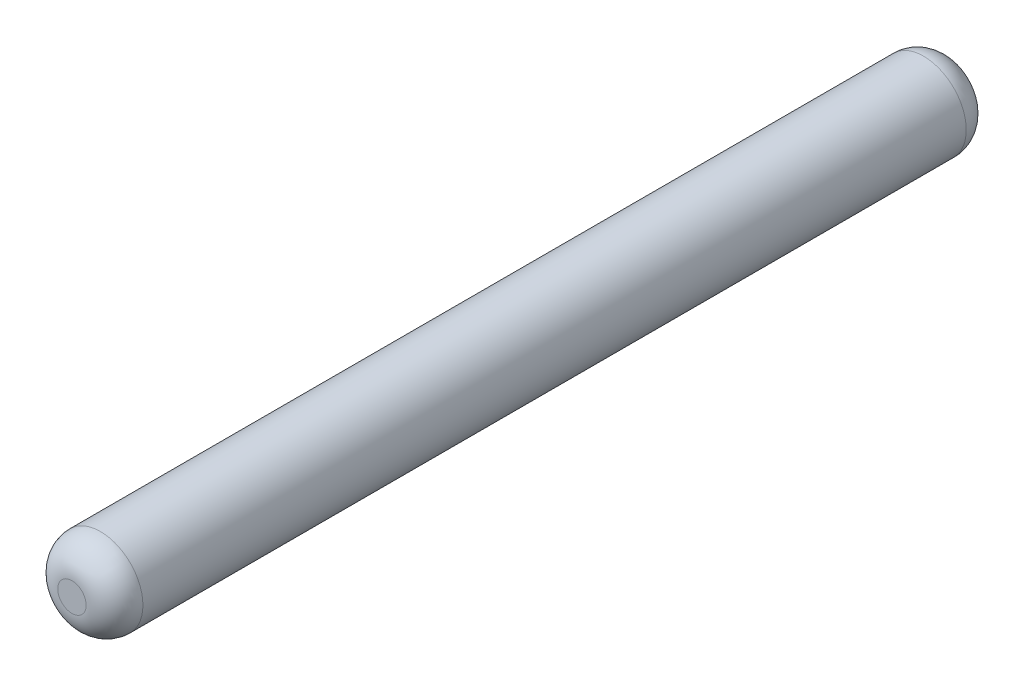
ISO-10303-21;
HEADER;
FILE_DESCRIPTION(('STEP AP214'),'2;1');
FILE_NAME('part.step','',(''),(''),'','','');
FILE_SCHEMA(('AUTOMOTIVE_DESIGN { 1 0 10303 214 1 1 1 1 }'));
ENDSEC;
DATA;
#1=APPLICATION_CONTEXT('core data for automotive mechanical design processes');
#2=APPLICATION_PROTOCOL_DEFINITION('international standard','automotive_design',2000,#1);
#3=PRODUCT_CONTEXT('',#1,'mechanical');
#4=PRODUCT('Part','Part','',(#3));
#5=PRODUCT_RELATED_PRODUCT_CATEGORY('part','',(#4));
#6=PRODUCT_DEFINITION_FORMATION('','',#4);
#7=PRODUCT_DEFINITION_CONTEXT('part definition',#1,'design');
#8=PRODUCT_DEFINITION('design','',#6,#7);
#9=PRODUCT_DEFINITION_SHAPE('','',#8);
#10=(LENGTH_UNIT() NAMED_UNIT(*) SI_UNIT(.MILLI.,.METRE.));
#11=(NAMED_UNIT(*) PLANE_ANGLE_UNIT() SI_UNIT($,.RADIAN.));
#12=(NAMED_UNIT(*) SI_UNIT($,.STERADIAN.) SOLID_ANGLE_UNIT());
#13=UNCERTAINTY_MEASURE_WITH_UNIT(LENGTH_MEASURE(1.E-05),#10,'distance_accuracy_value','');
#14=(GEOMETRIC_REPRESENTATION_CONTEXT(3) GLOBAL_UNCERTAINTY_ASSIGNED_CONTEXT((#13)) GLOBAL_UNIT_ASSIGNED_CONTEXT((#10,
#11,#12)) REPRESENTATION_CONTEXT('',''));
#15=CARTESIAN_POINT('',(0.,0.,0.));
#16=DIRECTION('',(0.,0.,1.));
#17=DIRECTION('',(1.,0.,0.));
#18=AXIS2_PLACEMENT_3D('',#15,#16,#17);
#19=CARTESIAN_POINT('',(0.,0.,62.));
#20=DIRECTION('',(0.,0.,-1.));
#21=DIRECTION('',(-1.,0.,0.));
#22=AXIS2_PLACEMENT_3D('',#19,#20,#21);
#23=PLANE('',#22);
#24=CARTESIAN_POINT('',(1.,0.,62.));
#25=CARTESIAN_POINT('',(0.999981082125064,-0.0183386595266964,61.9999999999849));
#26=CARTESIAN_POINT('',(0.999459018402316,-0.0366766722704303,61.9999999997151));
#27=CARTESIAN_POINT('',(0.997433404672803,-0.0729278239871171,61.9999999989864));
#28=CARTESIAN_POINT('',(0.995949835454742,-0.0908420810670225,61.9999999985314));
#29=CARTESIAN_POINT('',(0.992064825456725,-0.12619835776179,61.9999999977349));
#30=CARTESIAN_POINT('',(0.989682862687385,-0.143642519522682,61.9999999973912));
#31=CARTESIAN_POINT('',(0.984066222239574,-0.17801775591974,61.9999999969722));
#32=CARTESIAN_POINT('',(0.980850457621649,-0.194951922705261,61.9999999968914));
#33=CARTESIAN_POINT('',(0.973631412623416,-0.228272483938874,61.9999999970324));
#34=CARTESIAN_POINT('',(0.96964644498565,-0.244662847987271,61.9999999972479));
#35=CARTESIAN_POINT('',(0.960953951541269,-0.276867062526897,61.9999999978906));
#36=CARTESIAN_POINT('',(0.956264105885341,-0.292685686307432,61.9999999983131));
#37=CARTESIAN_POINT('',(0.946226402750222,-0.3237231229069,61.9999999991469));
#38=CARTESIAN_POINT('',(0.940895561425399,-0.338947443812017,61.9999999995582));
#39=CARTESIAN_POINT('',(0.929638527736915,-0.368778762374,62.0000000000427));
#40=CARTESIAN_POINT('',(0.923728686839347,-0.383391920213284,62.0000000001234));
#41=CARTESIAN_POINT('',(0.913975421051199,-0.405973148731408,61.9999999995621));
#42=CARTESIAN_POINT('',(0.910363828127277,-0.414042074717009,61.9999999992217));
#43=CARTESIAN_POINT('',(0.903376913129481,-0.429112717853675,61.9999999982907));
#44=CARTESIAN_POINT('',(0.900025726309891,-0.436125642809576,61.9999999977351));
#45=CARTESIAN_POINT('',(0.88858060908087,-0.459367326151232,61.9999999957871));
#46=CARTESIAN_POINT('',(0.880120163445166,-0.475417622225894,61.9999999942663));
#47=CARTESIAN_POINT('',(0.862330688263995,-0.507028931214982,61.9999999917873));
#48=CARTESIAN_POINT('',(0.853001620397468,-0.522589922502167,61.9999999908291));
#49=CARTESIAN_POINT('',(0.833502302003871,-0.553176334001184,61.999999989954));
#50=CARTESIAN_POINT('',(0.823332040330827,-0.568201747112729,61.9999999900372));
#51=CARTESIAN_POINT('',(0.802181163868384,-0.597670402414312,61.9999999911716));
#52=CARTESIAN_POINT('',(0.791200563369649,-0.612113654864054,61.9999999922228));
#53=CARTESIAN_POINT('',(0.76846430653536,-0.640375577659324,61.9999999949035));
#54=CARTESIAN_POINT('',(0.756708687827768,-0.654194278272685,61.9999999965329));
#55=CARTESIAN_POINT('',(0.732451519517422,-0.681159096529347,61.9999999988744));
#56=CARTESIAN_POINT('',(0.71995002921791,-0.694305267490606,61.9999999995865));
#57=CARTESIAN_POINT('',(0.694218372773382,-0.719953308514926,62.0000000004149));
#58=CARTESIAN_POINT('',(0.680985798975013,-0.732452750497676,62.0000000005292));
#59=CARTESIAN_POINT('',(0.651985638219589,-0.758527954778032,61.9999999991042));
#60=CARTESIAN_POINT('',(0.636126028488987,-0.772002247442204,61.9999999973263));
#61=CARTESIAN_POINT('',(0.612000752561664,-0.791168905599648,61.9999999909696));
#62=CARTESIAN_POINT('',(0.604060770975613,-0.797274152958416,61.9999999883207));
#63=CARTESIAN_POINT('',(0.579285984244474,-0.815702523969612,61.999999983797));
#64=CARTESIAN_POINT('',(0.56212988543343,-0.827599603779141,61.9999999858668));
#65=CARTESIAN_POINT('',(0.538098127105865,-0.843175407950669,61.9999999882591));
#66=CARTESIAN_POINT('',(0.531523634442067,-0.847328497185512,61.9999999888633));
#67=CARTESIAN_POINT('',(0.515446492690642,-0.857222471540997,61.9999999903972));
#68=CARTESIAN_POINT('',(0.505893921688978,-0.86288289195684,61.9999999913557));
#69=CARTESIAN_POINT('',(0.487352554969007,-0.873457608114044,61.9999999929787));
#70=CARTESIAN_POINT('',(0.47837730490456,-0.878395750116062,61.9999999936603));
#71=CARTESIAN_POINT('',(0.457934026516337,-0.889237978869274,61.999999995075));
#72=CARTESIAN_POINT('',(0.446422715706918,-0.895060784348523,61.9999999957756));
#73=CARTESIAN_POINT('',(0.424700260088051,-0.905526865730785,61.9999999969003));
#74=CARTESIAN_POINT('',(0.41451543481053,-0.91022491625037,61.9999999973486));
#75=CARTESIAN_POINT('',(0.395533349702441,-0.918597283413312,61.9999999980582));
#76=CARTESIAN_POINT('',(0.386757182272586,-0.922319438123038,61.9999999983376));
#77=CARTESIAN_POINT('',(0.370661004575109,-0.928877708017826,61.9999999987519));
#78=CARTESIAN_POINT('',(0.363357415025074,-0.931754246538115,61.9999999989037));
#79=CARTESIAN_POINT('',(0.346065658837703,-0.93833021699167,61.9999999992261));
#80=CARTESIAN_POINT('',(0.336049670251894,-0.941956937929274,61.9999999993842));
#81=CARTESIAN_POINT('',(0.323084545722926,-0.946429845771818,61.99999999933));
#82=CARTESIAN_POINT('',(0.320183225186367,-0.947416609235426,61.9999999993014));
#83=CARTESIAN_POINT('',(0.310475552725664,-0.950672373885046,61.9999999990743));
#84=CARTESIAN_POINT('',(0.303650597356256,-0.952886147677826,61.9999999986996));
#85=CARTESIAN_POINT('',(0.280822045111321,-0.960013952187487,61.9999999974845));
#86=CARTESIAN_POINT('',(0.264712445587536,-0.964593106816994,61.9999999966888));
#87=CARTESIAN_POINT('',(0.232283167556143,-0.972932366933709,61.9999999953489));
#88=CARTESIAN_POINT('',(0.215963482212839,-0.976692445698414,61.9999999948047));
#89=CARTESIAN_POINT('',(0.183153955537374,-0.983380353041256,61.9999999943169));
#90=CARTESIAN_POINT('',(0.166664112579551,-0.98630817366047,61.9999999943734));
#91=CARTESIAN_POINT('',(0.13355762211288,-0.991324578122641,61.9999999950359));
#92=CARTESIAN_POINT('',(0.116940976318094,-0.993413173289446,61.9999999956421));
#93=CARTESIAN_POINT('',(0.0836237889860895,-0.996746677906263,61.9999999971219));
#94=CARTESIAN_POINT('',(0.0669232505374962,-0.99799161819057,61.9999999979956));
#95=CARTESIAN_POINT('',(0.0334815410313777,-0.999630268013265,61.9999999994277));
#96=CARTESIAN_POINT('',(0.0167403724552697,-1.00002402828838,61.9999999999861));
#97=CARTESIAN_POINT('',(-0.0167205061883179,-0.999976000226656,62.0000000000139));
#98=CARTESIAN_POINT('',(-0.0334402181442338,-0.999535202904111,61.9999999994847));
#99=CARTESIAN_POINT('',(-0.0668376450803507,-0.997837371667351,61.9999999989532));
#100=CARTESIAN_POINT('',(-0.0835153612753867,-0.996580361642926,61.9999999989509));
#101=CARTESIAN_POINT('',(-0.116789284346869,-0.993249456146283,61.9999999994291));
#102=CARTESIAN_POINT('',(-0.133385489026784,-0.991175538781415,61.9999999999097));
#103=CARTESIAN_POINT('',(-0.166458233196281,-0.986213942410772,62.0000000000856));
#104=CARTESIAN_POINT('',(-0.182934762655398,-0.983326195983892,61.999999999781));
#105=CARTESIAN_POINT('',(-0.204014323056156,-0.979101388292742,61.9999999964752));
#106=CARTESIAN_POINT('',(-0.208692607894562,-0.978129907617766,61.9999999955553));
#107=CARTESIAN_POINT('',(-0.225051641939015,-0.974603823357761,61.9999999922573));
#108=CARTESIAN_POINT('',(-0.236692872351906,-0.971863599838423,61.9999999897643));
#109=CARTESIAN_POINT('',(-0.264496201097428,-0.964752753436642,61.9999999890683));
#110=CARTESIAN_POINT('',(-0.28060449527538,-0.960168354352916,61.9999999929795));
#111=CARTESIAN_POINT('',(-0.303410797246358,-0.952978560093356,61.999999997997));
#112=CARTESIAN_POINT('',(-0.310226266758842,-0.95073924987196,61.9999999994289));
#113=CARTESIAN_POINT('',(-0.321946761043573,-0.94677453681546,62.0000000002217));
#114=CARTESIAN_POINT('',(-0.32686137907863,-0.945077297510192,62.0000000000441));
#115=CARTESIAN_POINT('',(-0.348352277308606,-0.93748647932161,61.9999999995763));
#116=CARTESIAN_POINT('',(-0.364804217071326,-0.931232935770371,62.0000000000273));
#117=CARTESIAN_POINT('',(-0.39487161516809,-0.918887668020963,61.99999999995));
#118=CARTESIAN_POINT('',(-0.408536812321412,-0.912916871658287,61.9999999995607));
#119=CARTESIAN_POINT('',(-0.42911270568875,-0.903376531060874,61.9999999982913));
#120=CARTESIAN_POINT('',(-0.436125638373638,-0.900025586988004,61.9999999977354));
#121=CARTESIAN_POINT('',(-0.459367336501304,-0.888580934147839,61.9999999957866));
#122=CARTESIAN_POINT('',(-0.475417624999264,-0.880120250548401,61.9999999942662));
#123=CARTESIAN_POINT('',(-0.507028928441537,-0.862330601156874,61.9999999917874));
#124=CARTESIAN_POINT('',(-0.522589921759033,-0.853001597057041,61.9999999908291));
#125=CARTESIAN_POINT('',(-0.55317633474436,-0.83350232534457,61.9999999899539));
#126=CARTESIAN_POINT('',(-0.56820174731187,-0.823332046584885,61.9999999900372));
#127=CARTESIAN_POINT('',(-0.597670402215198,-0.802181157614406,61.9999999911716));
#128=CARTESIAN_POINT('',(-0.612113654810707,-0.791200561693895,61.9999999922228));
#129=CARTESIAN_POINT('',(-0.640375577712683,-0.768464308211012,61.9999999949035));
#130=CARTESIAN_POINT('',(-0.65419427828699,-0.756708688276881,61.9999999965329));
#131=CARTESIAN_POINT('',(-0.681159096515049,-0.732451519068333,61.9999999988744));
#132=CARTESIAN_POINT('',(-0.694305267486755,-0.719950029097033,61.9999999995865));
#133=CARTESIAN_POINT('',(-0.719953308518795,-0.69421837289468,62.0000000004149));
#134=CARTESIAN_POINT('',(-0.732452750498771,-0.680985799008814,62.0000000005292));
#135=CARTESIAN_POINT('',(-0.758527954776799,-0.651985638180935,61.9999999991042));
#136=CARTESIAN_POINT('',(-0.772002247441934,-0.636126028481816,61.9999999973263));
#137=CARTESIAN_POINT('',(-0.791168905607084,-0.612000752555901,61.9999999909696));
#138=CARTESIAN_POINT('',(-0.797274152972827,-0.604060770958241,61.9999999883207));
#139=CARTESIAN_POINT('',(-0.81570252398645,-0.579285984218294,61.999999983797));
#140=CARTESIAN_POINT('',(-0.827599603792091,-0.562129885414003,61.9999999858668));
#141=CARTESIAN_POINT('',(-0.843175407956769,-0.538098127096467,61.9999999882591));
#142=CARTESIAN_POINT('',(-0.847328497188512,-0.53152363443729,61.9999999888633));
#143=CARTESIAN_POINT('',(-0.857222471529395,-0.515446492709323,61.9999999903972));
#144=CARTESIAN_POINT('',(-0.862882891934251,-0.505893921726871,61.9999999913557));
#145=CARTESIAN_POINT('',(-0.87345760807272,-0.487352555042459,61.9999999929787));
#146=CARTESIAN_POINT('',(-0.878395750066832,-0.478377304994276,61.9999999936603));
#147=CARTESIAN_POINT('',(-0.88923797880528,-0.457934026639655,61.999999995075));
#148=CARTESIAN_POINT('',(-0.895060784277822,-0.446422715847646,61.9999999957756));
#149=CARTESIAN_POINT('',(-0.905526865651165,-0.424700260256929,61.9999999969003));
#150=CARTESIAN_POINT('',(-0.910224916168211,-0.414515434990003,61.9999999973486));
#151=CARTESIAN_POINT('',(-0.918597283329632,-0.39553334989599,61.9999999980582));
#152=CARTESIAN_POINT('',(-0.922319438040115,-0.386757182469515,61.9999999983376));
#153=CARTESIAN_POINT('',(-0.928877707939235,-0.370661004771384,61.9999999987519));
#154=CARTESIAN_POINT('',(-0.93175424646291,-0.363357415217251,61.9999999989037));
#155=CARTESIAN_POINT('',(-0.938330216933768,-0.346065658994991,61.9999999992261));
#156=CARTESIAN_POINT('',(-0.94195693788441,-0.336049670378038,61.9999999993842));
#157=CARTESIAN_POINT('',(-0.946429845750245,-0.323084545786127,61.99999999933));
#158=CARTESIAN_POINT('',(-0.947416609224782,-0.320183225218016,61.9999999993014));
#159=CARTESIAN_POINT('',(-0.950672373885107,-0.310475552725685,61.9999999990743));
#160=CARTESIAN_POINT('',(-0.952886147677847,-0.303650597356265,61.9999999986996));
#161=CARTESIAN_POINT('',(-0.960013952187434,-0.280822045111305,61.9999999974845));
#162=CARTESIAN_POINT('',(-0.964593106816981,-0.264712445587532,61.9999999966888));
#163=CARTESIAN_POINT('',(-0.972932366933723,-0.232283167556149,61.9999999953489));
#164=CARTESIAN_POINT('',(-0.976692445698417,-0.215963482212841,61.9999999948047));
#165=CARTESIAN_POINT('',(-0.983380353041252,-0.183153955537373,61.9999999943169));
#166=CARTESIAN_POINT('',(-0.986308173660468,-0.166664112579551,61.9999999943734));
#167=CARTESIAN_POINT('',(-0.991324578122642,-0.133557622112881,61.9999999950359));
#168=CARTESIAN_POINT('',(-0.993413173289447,-0.116940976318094,61.9999999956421));
#169=CARTESIAN_POINT('',(-0.996746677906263,-0.0836237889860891,61.9999999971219));
#170=CARTESIAN_POINT('',(-0.99799161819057,-0.0669232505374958,61.9999999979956));
#171=CARTESIAN_POINT('',(-0.999630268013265,-0.0334815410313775,61.9999999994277));
#172=CARTESIAN_POINT('',(-1.00002402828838,-0.0167403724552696,61.9999999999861));
#173=CARTESIAN_POINT('',(-0.999976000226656,0.016720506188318,62.0000000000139));
#174=CARTESIAN_POINT('',(-0.99953520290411,0.0334402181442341,61.9999999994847));
#175=CARTESIAN_POINT('',(-0.99783737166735,0.0668376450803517,61.9999999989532));
#176=CARTESIAN_POINT('',(-0.996580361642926,0.0835153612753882,61.9999999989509));
#177=CARTESIAN_POINT('',(-0.993249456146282,0.116789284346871,61.9999999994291));
#178=CARTESIAN_POINT('',(-0.991175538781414,0.133385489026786,61.9999999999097));
#179=CARTESIAN_POINT('',(-0.986213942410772,0.166458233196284,62.0000000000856));
#180=CARTESIAN_POINT('',(-0.983326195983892,0.182934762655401,61.999999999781));
#181=CARTESIAN_POINT('',(-0.979101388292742,0.20401432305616,61.9999999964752));
#182=CARTESIAN_POINT('',(-0.978129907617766,0.208692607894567,61.9999999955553));
#183=CARTESIAN_POINT('',(-0.97460382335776,0.225051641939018,61.9999999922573));
#184=CARTESIAN_POINT('',(-0.97186359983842,0.236692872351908,61.9999999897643));
#185=CARTESIAN_POINT('',(-0.964752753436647,0.264496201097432,61.9999999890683));
#186=CARTESIAN_POINT('',(-0.960168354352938,0.280604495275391,61.9999999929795));
#187=CARTESIAN_POINT('',(-0.952978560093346,0.303410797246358,61.999999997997));
#188=CARTESIAN_POINT('',(-0.950739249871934,0.310226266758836,61.9999999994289));
#189=CARTESIAN_POINT('',(-0.946774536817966,0.321946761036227,62.0000000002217));
#190=CARTESIAN_POINT('',(-0.945077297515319,0.326861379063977,62.0000000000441));
#191=CARTESIAN_POINT('',(-0.9374864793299,0.348352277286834,61.9999999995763));
#192=CARTESIAN_POINT('',(-0.931232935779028,0.364804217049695,62.0000000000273));
#193=CARTESIAN_POINT('',(-0.918887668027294,0.394871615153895,61.99999999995));
#194=CARTESIAN_POINT('',(-0.912916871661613,0.408536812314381,61.9999999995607));
#195=CARTESIAN_POINT('',(-0.90337653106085,0.42911270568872,61.9999999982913));
#196=CARTESIAN_POINT('',(-0.900025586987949,0.436125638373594,61.9999999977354));
#197=CARTESIAN_POINT('',(-0.888580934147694,0.459367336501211,61.9999999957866));
#198=CARTESIAN_POINT('',(-0.880120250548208,0.475417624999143,61.9999999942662));
#199=CARTESIAN_POINT('',(-0.862330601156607,0.507028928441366,61.9999999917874));
#200=CARTESIAN_POINT('',(-0.853001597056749,0.52258992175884,61.9999999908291));
#201=CARTESIAN_POINT('',(-0.833502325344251,0.553176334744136,61.9999999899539));
#202=CARTESIAN_POINT('',(-0.823332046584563,0.568201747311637,61.9999999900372));
#203=CARTESIAN_POINT('',(-0.802181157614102,0.597670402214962,61.9999999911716));
#204=CARTESIAN_POINT('',(-0.791200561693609,0.612113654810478,61.9999999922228));
#205=CARTESIAN_POINT('',(-0.768464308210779,0.640375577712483,61.9999999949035));
#206=CARTESIAN_POINT('',(-0.756708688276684,0.654194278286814,61.9999999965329));
#207=CARTESIAN_POINT('',(-0.732451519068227,0.681159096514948,61.9999999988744));
#208=CARTESIAN_POINT('',(-0.719950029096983,0.694305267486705,61.9999999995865));
#209=CARTESIAN_POINT('',(-0.69421837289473,0.719953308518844,62.0000000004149));
#210=CARTESIAN_POINT('',(-0.680985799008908,0.732452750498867,62.0000000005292));
#211=CARTESIAN_POINT('',(-0.65198563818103,0.75852795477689,61.9999999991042));
#212=CARTESIAN_POINT('',(-0.636126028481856,0.772002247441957,61.9999999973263));
#213=CARTESIAN_POINT('',(-0.612000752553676,0.791168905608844,61.9999999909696));
#214=CARTESIAN_POINT('',(-0.604060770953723,0.79727415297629,61.9999999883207));
#215=CARTESIAN_POINT('',(-0.579285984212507,0.815702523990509,61.999999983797));
#216=CARTESIAN_POINT('',(-0.562129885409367,0.827599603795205,61.9999999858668));
#217=CARTESIAN_POINT('',(-0.538098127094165,0.843175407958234,61.9999999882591));
#218=CARTESIAN_POINT('',(-0.531523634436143,0.847328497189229,61.9999999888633));
#219=CARTESIAN_POINT('',(-0.515446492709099,0.857222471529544,61.9999999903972));
#220=CARTESIAN_POINT('',(-0.505893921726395,0.862882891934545,61.9999999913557));
#221=CARTESIAN_POINT('',(-0.487352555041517,0.873457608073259,61.9999999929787));
#222=CARTESIAN_POINT('',(-0.47837730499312,0.878395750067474,61.9999999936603));
#223=CARTESIAN_POINT('',(-0.457934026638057,0.889237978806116,61.999999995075));
#224=CARTESIAN_POINT('',(-0.446422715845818,0.895060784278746,61.9999999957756));
#225=CARTESIAN_POINT('',(-0.424700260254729,0.905526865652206,61.9999999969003));
#226=CARTESIAN_POINT('',(-0.414515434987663,0.910224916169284,61.9999999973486));
#227=CARTESIAN_POINT('',(-0.395533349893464,0.918597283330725,61.9999999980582));
#228=CARTESIAN_POINT('',(-0.386757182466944,0.922319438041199,61.9999999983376));
#229=CARTESIAN_POINT('',(-0.370661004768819,0.928877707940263,61.9999999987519));
#230=CARTESIAN_POINT('',(-0.363357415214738,0.931754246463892,61.9999999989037));
#231=CARTESIAN_POINT('',(-0.346065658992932,0.938330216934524,61.9999999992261));
#232=CARTESIAN_POINT('',(-0.336049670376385,0.941956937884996,61.9999999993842));
#233=CARTESIAN_POINT('',(-0.323084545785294,0.946429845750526,61.99999999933));
#234=CARTESIAN_POINT('',(-0.320183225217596,0.947416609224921,61.9999999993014));
#235=CARTESIAN_POINT('',(-0.310475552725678,0.950672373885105,61.9999999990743));
#236=CARTESIAN_POINT('',(-0.303650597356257,0.952886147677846,61.9999999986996));
#237=CARTESIAN_POINT('',(-0.280822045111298,0.960013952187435,61.9999999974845));
#238=CARTESIAN_POINT('',(-0.264712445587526,0.964593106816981,61.9999999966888));
#239=CARTESIAN_POINT('',(-0.232283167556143,0.972932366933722,61.9999999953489));
#240=CARTESIAN_POINT('',(-0.215963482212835,0.976692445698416,61.9999999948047));
#241=CARTESIAN_POINT('',(-0.183153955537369,0.983380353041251,61.9999999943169));
#242=CARTESIAN_POINT('',(-0.166664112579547,0.986308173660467,61.9999999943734));
#243=CARTESIAN_POINT('',(-0.133557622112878,0.99132457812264,61.9999999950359));
#244=CARTESIAN_POINT('',(-0.116940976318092,0.993413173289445,61.9999999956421));
#245=CARTESIAN_POINT('',(-0.0836237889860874,0.996746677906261,61.9999999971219));
#246=CARTESIAN_POINT('',(-0.0669232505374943,0.997991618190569,61.9999999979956));
#247=CARTESIAN_POINT('',(-0.0334815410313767,0.999630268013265,61.9999999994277));
#248=CARTESIAN_POINT('',(-0.0167403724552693,1.00002402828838,61.9999999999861));
#249=CARTESIAN_POINT('',(0.0167205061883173,0.999976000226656,62.0000000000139));
#250=CARTESIAN_POINT('',(0.033440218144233,0.999535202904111,61.9999999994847));
#251=CARTESIAN_POINT('',(0.0668376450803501,0.997837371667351,61.9999999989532));
#252=CARTESIAN_POINT('',(0.0835153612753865,0.996580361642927,61.9999999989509));
#253=CARTESIAN_POINT('',(0.116789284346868,0.993249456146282,61.9999999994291));
#254=CARTESIAN_POINT('',(0.133385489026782,0.991175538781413,61.9999999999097));
#255=CARTESIAN_POINT('',(0.166458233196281,0.986213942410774,62.0000000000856));
#256=CARTESIAN_POINT('',(0.182934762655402,0.9833261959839,61.999999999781));
#257=CARTESIAN_POINT('',(0.204014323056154,0.97910138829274,61.9999999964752));
#258=CARTESIAN_POINT('',(0.208692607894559,0.978129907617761,61.9999999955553));
#259=CARTESIAN_POINT('',(0.225051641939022,0.974603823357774,61.9999999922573));
#260=CARTESIAN_POINT('',(0.236692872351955,0.971863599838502,61.9999999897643));
#261=CARTESIAN_POINT('',(0.264496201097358,0.964752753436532,61.9999999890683));
#262=CARTESIAN_POINT('',(0.280604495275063,0.960168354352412,61.9999999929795));
#263=CARTESIAN_POINT('',(0.303410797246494,0.952978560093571,61.999999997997));
#264=CARTESIAN_POINT('',(0.310226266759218,0.950739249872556,61.9999999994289));
#265=CARTESIAN_POINT('',(0.321946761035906,0.946774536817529,62.0000000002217));
#266=CARTESIAN_POINT('',(0.326861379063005,0.945077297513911,62.0000000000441));
#267=CARTESIAN_POINT('',(0.348352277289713,0.93748647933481,61.9999999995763));
#268=CARTESIAN_POINT('',(0.364804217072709,0.93123293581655,62.0000000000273));
#269=CARTESIAN_POINT('',(0.394871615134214,0.918887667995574,61.99999999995));
#270=CARTESIAN_POINT('',(0.408536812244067,0.912916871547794,61.9999999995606));
#271=CARTESIAN_POINT('',(0.429112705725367,0.903376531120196,61.9999999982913));
#272=CARTESIAN_POINT('',(0.436125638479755,0.900025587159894,61.9999999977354));
#273=CARTESIAN_POINT('',(0.459367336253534,0.888580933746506,61.9999999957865));
#274=CARTESIAN_POINT('',(0.475417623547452,0.880120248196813,61.9999999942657));
#275=CARTESIAN_POINT('',(0.507028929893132,0.862330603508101,61.9999999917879));
#276=CARTESIAN_POINT('',(0.522589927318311,0.853001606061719,61.9999999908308));
#277=CARTESIAN_POINT('',(0.5531763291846,0.833502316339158,61.9999999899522));
#278=CARTESIAN_POINT('',(0.568201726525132,0.823332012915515,61.9999999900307));
#279=CARTESIAN_POINT('',(0.597670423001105,0.802181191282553,61.9999999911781));
#280=CARTESIAN_POINT('',(0.612113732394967,0.791200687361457,61.9999999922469));
#281=CARTESIAN_POINT('',(0.64037550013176,0.768464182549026,61.9999999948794));
#282=CARTESIAN_POINT('',(0.654193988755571,0.756708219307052,61.999999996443));
#283=CARTESIAN_POINT('',(0.681159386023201,0.73245198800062,61.9999999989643));
#284=CARTESIAN_POINT('',(0.694306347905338,0.71995177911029,61.9999999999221));
#285=CARTESIAN_POINT('',(0.719903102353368,0.694265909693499,62.0000000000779));
#286=CARTESIAN_POINT('',(0.732353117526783,0.681080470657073,61.9999999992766));
#287=CARTESIAN_POINT('',(0.756547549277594,0.654077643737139,61.9999999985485));
#288=CARTESIAN_POINT('',(0.768291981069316,0.640260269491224,61.9999999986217));
#289=CARTESIAN_POINT('',(0.791026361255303,0.612017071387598,62.000000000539));
#290=CARTESIAN_POINT('',(0.802016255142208,0.59759120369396,62.0000000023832));
#291=CARTESIAN_POINT('',(0.820604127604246,0.571877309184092,61.9999999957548));
#292=CARTESIAN_POINT('',(0.828363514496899,0.560705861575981,61.9999999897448));
#293=CARTESIAN_POINT('',(0.844903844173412,0.535641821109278,61.9999999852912));
#294=CARTESIAN_POINT('',(0.853560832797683,0.521667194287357,61.9999999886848));
#295=CARTESIAN_POINT('',(0.870701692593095,0.492437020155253,61.9999999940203));
#296=CARTESIAN_POINT('',(0.87914160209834,0.477155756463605,61.9999999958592));
#297=CARTESIAN_POINT('',(0.891301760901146,0.453698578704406,61.9999999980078));
#298=CARTESIAN_POINT('',(0.895322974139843,0.445677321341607,61.9999999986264));
#299=CARTESIAN_POINT('',(0.907417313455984,0.420726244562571,61.9999999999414));
#300=CARTESIAN_POINT('',(0.915128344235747,0.403618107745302,61.9999999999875));
#301=CARTESIAN_POINT('',(0.924898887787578,0.380266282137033,62.000000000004));
#302=CARTESIAN_POINT('',(0.927372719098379,0.37419216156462,62.0000000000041));
#303=CARTESIAN_POINT('',(0.933873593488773,0.35778254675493,61.999999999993));
#304=CARTESIAN_POINT('',(0.937792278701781,0.347403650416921,61.9999999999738));
#305=CARTESIAN_POINT('',(0.945147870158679,0.326885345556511,61.9999999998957));
#306=CARTESIAN_POINT('',(0.948596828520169,0.316750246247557,61.9999999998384));
#307=CARTESIAN_POINT('',(0.955048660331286,0.296743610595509,61.9999999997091));
#308=CARTESIAN_POINT('',(0.958063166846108,0.286875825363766,61.9999999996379));
#309=CARTESIAN_POINT('',(0.963677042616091,0.2674239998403,61.9999999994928));
#310=CARTESIAN_POINT('',(0.966287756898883,0.257843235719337,61.9999999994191));
#311=CARTESIAN_POINT('',(0.971125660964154,0.23898403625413,61.9999999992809));
#312=CARTESIAN_POINT('',(0.973363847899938,0.22970840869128,61.9999999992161));
#313=CARTESIAN_POINT('',(0.979421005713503,0.202925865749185,61.9999999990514));
#314=CARTESIAN_POINT('',(0.982902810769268,0.185341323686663,61.9999999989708));
#315=CARTESIAN_POINT('',(0.988652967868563,0.151540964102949,61.9999999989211));
#316=CARTESIAN_POINT('',(0.991000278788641,0.135338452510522,61.9999999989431));
#317=CARTESIAN_POINT('',(0.994708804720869,0.104377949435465,61.9999999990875));
#318=CARTESIAN_POINT('',(0.996142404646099,0.0896286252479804,61.9999999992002));
#319=CARTESIAN_POINT('',(0.998233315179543,0.0616282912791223,61.9999999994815));
#320=CARTESIAN_POINT('',(0.998956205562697,0.0483821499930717,61.9999999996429));
#321=CARTESIAN_POINT('',(0.999816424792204,0.023422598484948,61.999999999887));
#322=CARTESIAN_POINT('',(1.00001236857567,0.0117111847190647,61.9999999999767));
#323=CARTESIAN_POINT('',(1.,0.,62.));
#324=B_SPLINE_CURVE_WITH_KNOTS('',3,(#24,#25,#26,#27,#28,#29,#30,#31,#32,#33,#34,#35,#36,#37,
#38,#39,#40,#41,#42,#43,#44,#45,#46,#47,#48,#49,#50,#51,#52,#53,#54,#55,#56,#57,#58,#59,#60,#61,
#62,#63,#64,#65,#66,#67,#68,#69,#70,#71,#72,#73,#74,#75,#76,#77,#78,#79,#80,#81,#82,#83,#84,#85,
#86,#87,#88,#89,#90,#91,#92,#93,#94,#95,#96,#97,#98,#99,#100,#101,#102,#103,#104,#105,#106,#107,
#108,#109,#110,#111,#112,#113,#114,#115,#116,#117,#118,#119,#120,#121,#122,#123,#124,#125,#126,
#127,#128,#129,#130,#131,#132,#133,#134,#135,#136,#137,#138,#139,#140,#141,#142,#143,#144,#145,
#146,#147,#148,#149,#150,#151,#152,#153,#154,#155,#156,#157,#158,#159,#160,#161,#162,#163,#164,
#165,#166,#167,#168,#169,#170,#171,#172,#173,#174,#175,#176,#177,#178,#179,#180,#181,#182,#183,
#184,#185,#186,#187,#188,#189,#190,#191,#192,#193,#194,#195,#196,#197,#198,#199,#200,#201,#202,
#203,#204,#205,#206,#207,#208,#209,#210,#211,#212,#213,#214,#215,#216,#217,#218,#219,#220,#221,
#222,#223,#224,#225,#226,#227,#228,#229,#230,#231,#232,#233,#234,#235,#236,#237,#238,#239,#240,
#241,#242,#243,#244,#245,#246,#247,#248,#249,#250,#251,#252,#253,#254,#255,#256,#257,#258,#259,
#260,#261,#262,#263,#264,#265,#266,#267,#268,#269,#270,#271,#272,#273,#274,#275,#276,#277,#278,
#279,#280,#281,#282,#283,#284,#285,#286,#287,#288,#289,#290,#291,#292,#293,#294,#295,#296,#297,
#298,#299,#300,#301,#302,#303,#304,#305,#306,#307,#308,#309,#310,#311,#312,#313,#314,#315,#316,
#317,#318,#319,#320,#321,#322,#323),.UNSPECIFIED.,.F.,.F.,(4,2,2,2,2,2,2,2,2,2,2,2,2,2,2,2,2,2,
2,2,2,2,2,2,2,2,2,2,2,2,2,2,2,2,2,2,2,2,2,2,2,2,2,2,2,2,2,2,2,2,2,2,2,2,2,2,2,2,2,2,2,2,2,2,2,2,
2,2,2,2,2,2,2,2,2,2,2,2,2,2,2,2,2,2,2,2,2,2,2,2,2,2,2,2,2,2,2,2,2,2,2,2,2,2,2,2,2,2,2,2,2,2,2,2,
2,2,2,2,2,2,2,2,2,2,2,2,2,2,2,2,2,2,2,2,2,2,2,2,2,2,2,2,2,2,2,2,2,2,2,4),(0.,0.0550088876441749,
0.108909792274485,0.161703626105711,0.213391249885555,0.26397347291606,0.313451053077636,
0.361824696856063,0.409095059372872,0.435613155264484,0.458928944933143,0.513329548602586,
0.567732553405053,0.62213627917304,0.676539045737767,0.730939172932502,0.785334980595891,
0.839922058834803,0.902310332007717,0.932354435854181,0.99493298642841,1.01826118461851,
1.05156509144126,1.08229292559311,1.12098323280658,1.1546255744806,1.18322018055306,
1.20676722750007,1.23871812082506,1.24791168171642,1.26943535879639,1.31965472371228,
1.36987572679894,1.42009721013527,1.47031801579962,1.52053698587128,1.57075296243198,
1.62090934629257,1.67106426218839,1.72122052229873,1.77138093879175,1.78571496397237,
1.8215847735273,1.87179917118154,1.89331966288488,1.90891781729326,1.96169365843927,
2.00641600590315,2.02973179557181,2.08413239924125,2.13853540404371,2.19293912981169,
2.24734189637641,2.30174202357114,2.35613783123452,2.41072490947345,2.47311318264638,
2.503157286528,2.56573583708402,2.58906403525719,2.62236794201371,2.65309577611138,
2.69178608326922,2.72542842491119,2.75402303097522,2.77757007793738,2.80952097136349,
2.81871453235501,2.84023820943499,2.89045757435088,2.94067857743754,2.99090006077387,
3.04112086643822,3.09133983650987,3.14155581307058,3.19171219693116,3.24186711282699,
3.29202337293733,3.34218378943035,3.35651781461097,3.3923876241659,3.44260202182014,
3.46412251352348,3.47972066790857,3.53249650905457,3.57721885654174,3.6005346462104,
3.65493524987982,3.70933825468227,3.76374198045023,3.81814474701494,3.87254487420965,
3.92694068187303,3.98152776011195,4.04391603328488,4.07396013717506,4.13653868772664,
4.15986688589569,4.19317079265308,4.22389862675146,4.26258893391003,4.29623127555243,
4.32482588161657,4.34837292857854,4.38032382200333,4.38951738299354,4.41104106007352,
4.46126042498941,4.51148142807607,4.56170291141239,4.61192371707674,4.6621426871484,
4.7123586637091,4.76251504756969,4.81266996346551,4.86282622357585,4.91298664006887,
4.92732066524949,4.96319047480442,5.01340487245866,5.034925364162,5.05052351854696,
5.10329935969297,5.14802170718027,5.17133749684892,5.22573810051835,5.28014110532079,
5.33454483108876,5.38894759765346,5.44334772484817,5.49774353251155,5.55212186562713,
5.60649902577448,5.66088010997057,5.70167363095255,5.75096579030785,5.80331212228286,
5.83022838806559,5.88648953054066,5.90616475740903,5.93943999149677,5.97155215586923,
6.00250113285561,6.03228681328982,6.06090909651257,6.11465823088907,6.16375393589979,
6.2081955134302,6.24798242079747,6.28311427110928),.UNSPECIFIED.);
#325=CARTESIAN_POINT('',(1.,0.,62.));
#326=VERTEX_POINT('',#325);
#327=EDGE_CURVE('E32',#326,#326,#324,.T.);
#328=ORIENTED_EDGE('',*,*,#327,.F.);
#329=EDGE_LOOP('',(#328));
#330=FACE_BOUND('',#329,.T.);
#331=ADVANCED_FACE('F14',(#330),#23,.F.);
#332=CARTESIAN_POINT('',(0.,0.,0.));
#333=DIRECTION('',(0.,0.,-1.));
#334=DIRECTION('',(-1.,0.,0.));
#335=AXIS2_PLACEMENT_3D('',#332,#333,#334);
#336=PLANE('',#335);
#337=CARTESIAN_POINT('',(0.,0.,0.));
#338=DIRECTION('',(0.,0.,1.));
#339=DIRECTION('',(1.,0.,0.));
#340=AXIS2_PLACEMENT_3D('',#337,#338,#339);
#341=CIRCLE('',#340,1.);
#342=CARTESIAN_POINT('',(1.,0.,0.));
#343=VERTEX_POINT('',#342);
#344=EDGE_CURVE('E18',#343,#343,#341,.T.);
#345=ORIENTED_EDGE('',*,*,#344,.F.);
#346=EDGE_LOOP('',(#345));
#347=FACE_BOUND('',#346,.T.);
#348=ADVANCED_FACE('F44',(#347),#336,.T.);
#349=CARTESIAN_POINT('',(0.,0.,60.));
#350=DIRECTION('',(0.,0.,1.));
#351=DIRECTION('',(1.,0.,0.));
#352=AXIS2_PLACEMENT_3D('',#349,#350,#351);
#353=DEGENERATE_TOROIDAL_SURFACE('',#352,1.,2.00000000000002,.T.);
#354=CARTESIAN_POINT('',(0.,0.,60.));
#355=DIRECTION('',(0.,0.,1.));
#356=DIRECTION('',(1.,0.,0.));
#357=AXIS2_PLACEMENT_3D('',#354,#355,#356);
#358=CIRCLE('',#357,3.);
#359=CARTESIAN_POINT('',(3.,0.,60.));
#360=VERTEX_POINT('',#359);
#361=EDGE_CURVE('E22',#360,#360,#358,.F.);
#362=ORIENTED_EDGE('',*,*,#361,.F.);
#363=EDGE_LOOP('',(#362));
#364=FACE_BOUND('',#363,.T.);
#365=ORIENTED_EDGE('',*,*,#327,.T.);
#366=EDGE_LOOP('',(#365));
#367=FACE_BOUND('',#366,.T.);
#368=ADVANCED_FACE('F35',(#364,#367),#353,.T.);
#369=CARTESIAN_POINT('',(0.,0.,2.));
#370=DIRECTION('',(0.,0.,1.));
#371=DIRECTION('',(1.,0.,0.));
#372=AXIS2_PLACEMENT_3D('',#369,#370,#371);
#373=DEGENERATE_TOROIDAL_SURFACE('',#372,1.,2.,.T.);
#374=ORIENTED_EDGE('',*,*,#344,.T.);
#375=EDGE_LOOP('',(#374));
#376=FACE_BOUND('',#375,.T.);
#377=CARTESIAN_POINT('',(0.,0.,2.));
#378=DIRECTION('',(0.,0.,1.));
#379=DIRECTION('',(1.,0.,0.));
#380=AXIS2_PLACEMENT_3D('',#377,#378,#379);
#381=CIRCLE('',#380,3.);
#382=CARTESIAN_POINT('',(3.,0.,2.));
#383=VERTEX_POINT('',#382);
#384=EDGE_CURVE('E10',#383,#383,#381,.T.);
#385=ORIENTED_EDGE('',*,*,#384,.F.);
#386=EDGE_LOOP('',(#385));
#387=FACE_BOUND('',#386,.T.);
#388=ADVANCED_FACE('F16',(#376,#387),#373,.T.);
#389=CARTESIAN_POINT('',(0.,0.,0.));
#390=DIRECTION('',(0.,0.,1.));
#391=DIRECTION('',(1.,0.,0.));
#392=AXIS2_PLACEMENT_3D('',#389,#390,#391);
#393=CYLINDRICAL_SURFACE('',#392,3.);
#394=ORIENTED_EDGE('',*,*,#384,.T.);
#395=EDGE_LOOP('',(#394));
#396=FACE_BOUND('',#395,.T.);
#397=ORIENTED_EDGE('',*,*,#361,.T.);
#398=EDGE_LOOP('',(#397));
#399=FACE_BOUND('',#398,.T.);
#400=ADVANCED_FACE('F52',(#396,#399),#393,.T.);
#401=CLOSED_SHELL('',(#331,#348,#368,#388,#400));
#402=MANIFOLD_SOLID_BREP('B1',#401);
#403=ADVANCED_BREP_SHAPE_REPRESENTATION('',(#18,#402),#14);
#404=SHAPE_DEFINITION_REPRESENTATION(#9,#403);
ENDSEC;
END-ISO-10303-21;
